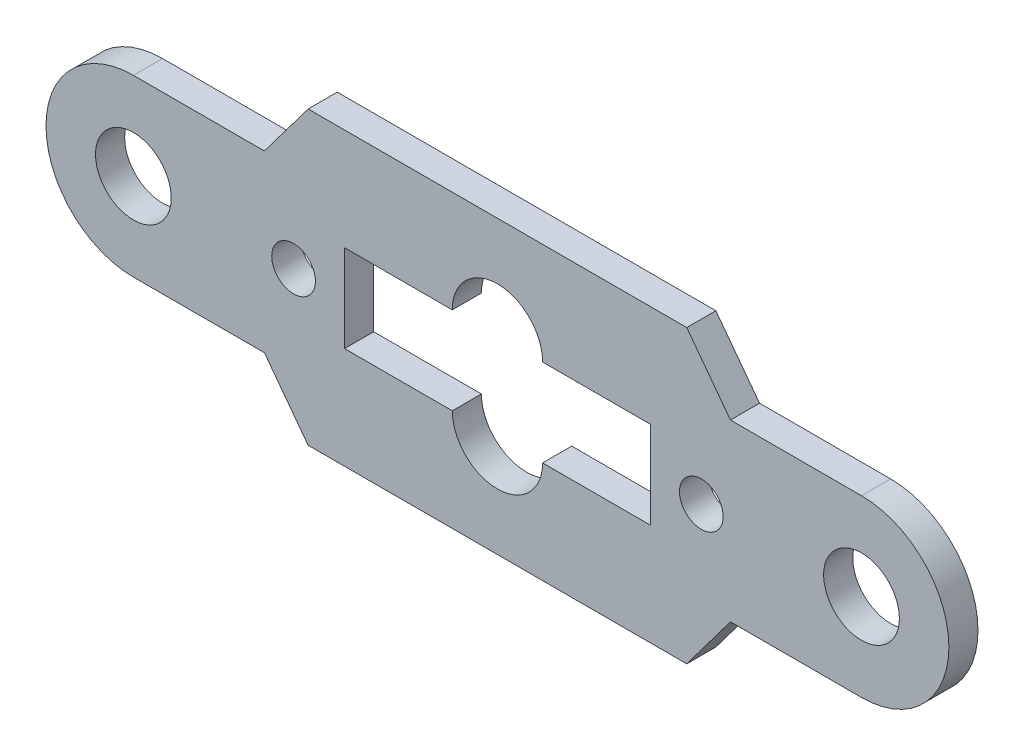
from build123d import *
from build123d.topology import SkipClean

# Parameters (mm, degrees)
EXTRUSION1_DEPTH = 1
ESQUISSE2_R      = 1.3
ESQUISSE2_R_2    = 0.75
EXTRUSION2_DEPTH = 17.317168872


with BuildPart() as part:
    # Esquisse1 → Extrusion1 (new body)
    with BuildSketch(Plane.XY):
        with BuildLine():
            Line((0, 0), (0, 5))
            Line((0, 5), (6.5, 5))
            Line((6.5, 5), (8, 3))
            Line((8, 3), (12.5, 3))
            ThreePointArc((12.5, 3), (14.621320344, 2.121320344), (15.5, 0))
            Line((15.5, 0), (0, 0))
        make_face()
    extrude(amount=EXTRUSION1_DEPTH)

    # Esquisse2 → Extrusion2 (cut, through all)
    with BuildSketch(Plane.XY.offset(1)):
        with Locations((12.5, 0)):
            Circle(ESQUISSE2_R)
        with Locations((7, 0)):
            Circle(ESQUISSE2_R_2)
        with BuildLine():
            Line((0, 0), (5.25, 0))
            Line((5.25, 0), (5.25, 1.5))
            Line((5.25, 1.5), (1.55, 1.5))
            ThreePointArc((1.55, 1.5), (-1.096015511, 2.596015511), (0, -0.05))
            Line((0, -0.05), (0, 0))
        make_face()
    extrude(amount=-EXTRUSION2_DEPTH, mode=Mode.SUBTRACT)

    # Sym_trie1: part across plane


with BuildPart() as part_1:
    with SkipClean():  # the faces are left unmerged after this step: merging them gives an invalid solid
        add(part.part)
        add(part.part.mirror(Plane(origin=(0, 0, 1), x_dir=(0, 0, 1), z_dir=(0, 1, 0))))

    # Sym_trie2: part across plane


with BuildPart() as part_2:
    with SkipClean():  # the faces are left unmerged after this step: merging them gives an invalid solid
        add(part_1.part)
        add(part_1.part.mirror(Plane(origin=(0, 0, 1), x_dir=(0, 0, 1), z_dir=(1, 0, 0))))


solid = part_2.part
